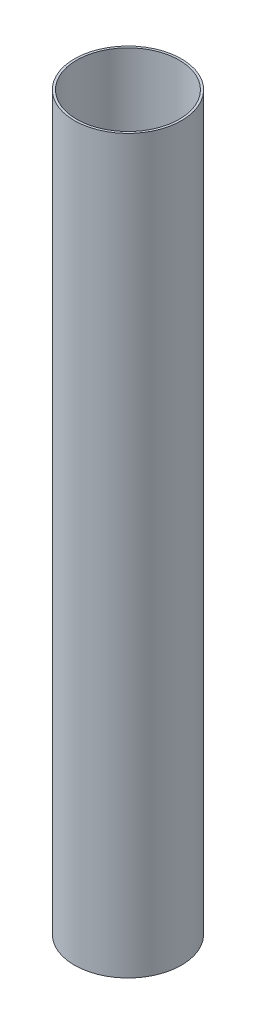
from build123d import *

# Parameters (mm, degrees)
SKETCH1_R           = 76.2
SKETCH1_R_2         = 73.025
BOSS_EXTRUDE1_DEPTH = 1041.4


with BuildPart() as part:
    # Sketch1 → Boss-Extrude1 (new body)
    with BuildSketch(Plane(origin=(0, 0, 0), x_dir=(1, 0, 0), z_dir=(0, 1, 0))):
        with Locations(Location((0, 0, 0), (0, 0, 270))):
            Circle(SKETCH1_R)
        with Locations(Location((0, 0, 0), (0, 0, 270))):
            Circle(SKETCH1_R_2, mode=Mode.SUBTRACT)
    extrude(amount=BOSS_EXTRUDE1_DEPTH)


solid = part.part
